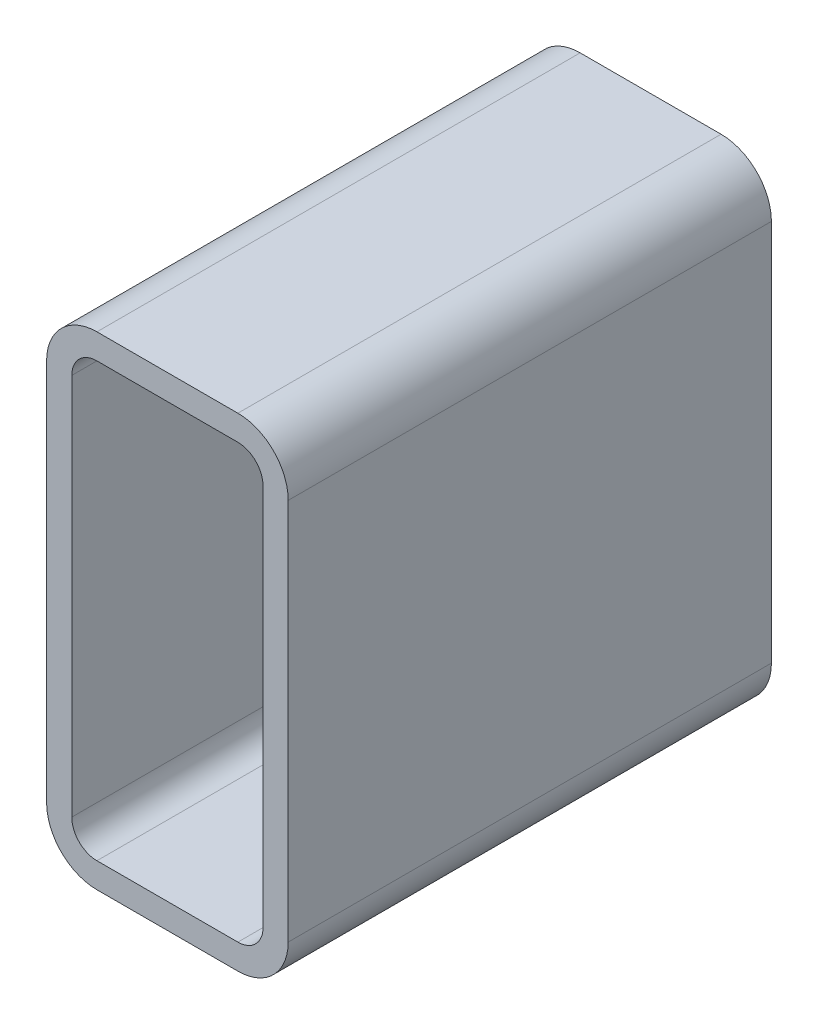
ISO-10303-21;
HEADER;
FILE_DESCRIPTION(('STEP AP214'),'2;1');
FILE_NAME('part.step','',(''),(''),'','','');
FILE_SCHEMA(('AUTOMOTIVE_DESIGN { 1 0 10303 214 1 1 1 1 }'));
ENDSEC;
DATA;
#1=APPLICATION_CONTEXT('core data for automotive mechanical design processes');
#2=APPLICATION_PROTOCOL_DEFINITION('international standard','automotive_design',2000,#1);
#3=PRODUCT_CONTEXT('',#1,'mechanical');
#4=PRODUCT('Part','Part','',(#3));
#5=PRODUCT_RELATED_PRODUCT_CATEGORY('part','',(#4));
#6=PRODUCT_DEFINITION_FORMATION('','',#4);
#7=PRODUCT_DEFINITION_CONTEXT('part definition',#1,'design');
#8=PRODUCT_DEFINITION('design','',#6,#7);
#9=PRODUCT_DEFINITION_SHAPE('','',#8);
#10=(LENGTH_UNIT() NAMED_UNIT(*) SI_UNIT(.MILLI.,.METRE.));
#11=(NAMED_UNIT(*) PLANE_ANGLE_UNIT() SI_UNIT($,.RADIAN.));
#12=(NAMED_UNIT(*) SI_UNIT($,.STERADIAN.) SOLID_ANGLE_UNIT());
#13=UNCERTAINTY_MEASURE_WITH_UNIT(LENGTH_MEASURE(1.E-05),#10,'distance_accuracy_value','');
#14=(GEOMETRIC_REPRESENTATION_CONTEXT(3) GLOBAL_UNCERTAINTY_ASSIGNED_CONTEXT((#13)) GLOBAL_UNIT_ASSIGNED_CONTEXT((#10,
#11,#12)) REPRESENTATION_CONTEXT('',''));
#15=CARTESIAN_POINT('',(0.,0.,0.));
#16=DIRECTION('',(0.,0.,1.));
#17=DIRECTION('',(1.,0.,0.));
#18=AXIS2_PLACEMENT_3D('',#15,#16,#17);
#19=CARTESIAN_POINT('',(31.7973013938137,274.924496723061,304.8));
#20=DIRECTION('',(0.,0.,1.));
#21=DIRECTION('',(1.,0.,0.));
#22=AXIS2_PLACEMENT_3D('',#19,#20,#21);
#23=PLANE('',#22);
#24=CARTESIAN_POINT('',(31.7973013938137,274.924496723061,304.8));
#25=DIRECTION('',(0.,0.,1.));
#26=DIRECTION('',(1.,0.,0.));
#27=AXIS2_PLACEMENT_3D('',#24,#25,#26);
#28=CIRCLE('',#27,31.75);
#29=CARTESIAN_POINT('',(31.7973013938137,306.674496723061,304.8));
#30=VERTEX_POINT('',#29);
#31=CARTESIAN_POINT('',(0.0473013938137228,274.924496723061,304.8));
#32=VERTEX_POINT('',#31);
#33=EDGE_CURVE('E211',#30,#32,#28,.T.);
#34=ORIENTED_EDGE('',*,*,#33,.T.);
#35=DIRECTION('',(0.,-1.,0.));
#36=VECTOR('',#35,1.);
#37=CARTESIAN_POINT('',(0.0473013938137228,33.6244967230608,304.8));
#38=LINE('',#37,#36);
#39=CARTESIAN_POINT('',(0.0473013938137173,33.6244967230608,304.8));
#40=VERTEX_POINT('',#39);
#41=EDGE_CURVE('E214',#32,#40,#38,.T.);
#42=ORIENTED_EDGE('',*,*,#41,.T.);
#43=CARTESIAN_POINT('',(31.7973013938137,33.6244967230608,304.8));
#44=DIRECTION('',(0.,0.,1.));
#45=DIRECTION('',(1.,0.,0.));
#46=AXIS2_PLACEMENT_3D('',#43,#44,#45);
#47=CIRCLE('',#46,31.75);
#48=CARTESIAN_POINT('',(31.7973013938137,1.87449672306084,304.8));
#49=VERTEX_POINT('',#48);
#50=EDGE_CURVE('E217',#40,#49,#47,.T.);
#51=ORIENTED_EDGE('',*,*,#50,.T.);
#52=DIRECTION('',(1.,0.,0.));
#53=VECTOR('',#52,1.);
#54=CARTESIAN_POINT('',(120.697301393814,1.87449672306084,304.8));
#55=LINE('',#54,#53);
#56=CARTESIAN_POINT('',(120.697301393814,1.87449672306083,304.8));
#57=VERTEX_POINT('',#56);
#58=EDGE_CURVE('E219',#49,#57,#55,.T.);
#59=ORIENTED_EDGE('',*,*,#58,.T.);
#60=CARTESIAN_POINT('',(120.697301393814,33.6244967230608,304.8));
#61=DIRECTION('',(0.,0.,1.));
#62=DIRECTION('',(1.,0.,0.));
#63=AXIS2_PLACEMENT_3D('',#60,#61,#62);
#64=CIRCLE('',#63,31.75);
#65=CARTESIAN_POINT('',(152.447301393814,33.6244967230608,304.8));
#66=VERTEX_POINT('',#65);
#67=EDGE_CURVE('E221',#57,#66,#64,.T.);
#68=ORIENTED_EDGE('',*,*,#67,.T.);
#69=DIRECTION('',(0.,1.,0.));
#70=VECTOR('',#69,1.);
#71=CARTESIAN_POINT('',(152.447301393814,274.924496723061,304.8));
#72=LINE('',#71,#70);
#73=CARTESIAN_POINT('',(152.447301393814,274.924496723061,304.8));
#74=VERTEX_POINT('',#73);
#75=EDGE_CURVE('E223',#66,#74,#72,.T.);
#76=ORIENTED_EDGE('',*,*,#75,.T.);
#77=CARTESIAN_POINT('',(120.697301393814,274.924496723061,304.8));
#78=DIRECTION('',(0.,0.,1.));
#79=DIRECTION('',(1.,0.,0.));
#80=AXIS2_PLACEMENT_3D('',#77,#78,#79);
#81=CIRCLE('',#80,31.75);
#82=CARTESIAN_POINT('',(120.697301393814,306.674496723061,304.8));
#83=VERTEX_POINT('',#82);
#84=EDGE_CURVE('E225',#74,#83,#81,.T.);
#85=ORIENTED_EDGE('',*,*,#84,.T.);
#86=DIRECTION('',(-1.,0.,0.));
#87=VECTOR('',#86,1.);
#88=CARTESIAN_POINT('',(31.7973013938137,306.674496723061,304.8));
#89=LINE('',#88,#87);
#90=EDGE_CURVE('E227',#83,#30,#89,.T.);
#91=ORIENTED_EDGE('',*,*,#90,.T.);
#92=EDGE_LOOP('',(#34,#42,#51,#59,#68,#76,#85,#91));
#93=FACE_BOUND('',#92,.T.);
#94=DIRECTION('',(0.,-1.,0.));
#95=VECTOR('',#94,1.);
#96=CARTESIAN_POINT('',(15.9223013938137,33.6244967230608,304.8));
#97=LINE('',#96,#95);
#98=CARTESIAN_POINT('',(15.9223013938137,274.924496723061,304.8));
#99=VERTEX_POINT('',#98);
#100=CARTESIAN_POINT('',(15.9223013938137,33.6244967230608,304.8));
#101=VERTEX_POINT('',#100);
#102=EDGE_CURVE('E154',#99,#101,#97,.T.);
#103=ORIENTED_EDGE('',*,*,#102,.F.);
#104=CARTESIAN_POINT('',(31.7973013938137,274.924496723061,304.8));
#105=DIRECTION('',(0.,0.,1.));
#106=DIRECTION('',(1.,0.,0.));
#107=AXIS2_PLACEMENT_3D('',#104,#105,#106);
#108=CIRCLE('',#107,15.875);
#109=CARTESIAN_POINT('',(31.7973013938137,290.799496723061,304.8));
#110=VERTEX_POINT('',#109);
#111=EDGE_CURVE('E146',#110,#99,#108,.T.);
#112=ORIENTED_EDGE('',*,*,#111,.F.);
#113=DIRECTION('',(-1.,0.,0.));
#114=VECTOR('',#113,1.);
#115=CARTESIAN_POINT('',(31.7973013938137,290.799496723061,304.8));
#116=LINE('',#115,#114);
#117=CARTESIAN_POINT('',(120.697301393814,290.799496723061,304.8));
#118=VERTEX_POINT('',#117);
#119=EDGE_CURVE('E179',#118,#110,#116,.T.);
#120=ORIENTED_EDGE('',*,*,#119,.F.);
#121=CARTESIAN_POINT('',(120.697301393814,274.924496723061,304.8));
#122=DIRECTION('',(0.,0.,1.));
#123=DIRECTION('',(1.,0.,0.));
#124=AXIS2_PLACEMENT_3D('',#121,#122,#123);
#125=CIRCLE('',#124,15.875);
#126=CARTESIAN_POINT('',(136.572301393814,274.924496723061,304.8));
#127=VERTEX_POINT('',#126);
#128=EDGE_CURVE('E177',#127,#118,#125,.T.);
#129=ORIENTED_EDGE('',*,*,#128,.F.);
#130=DIRECTION('',(0.,1.,0.));
#131=VECTOR('',#130,1.);
#132=CARTESIAN_POINT('',(136.572301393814,274.924496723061,304.8));
#133=LINE('',#132,#131);
#134=CARTESIAN_POINT('',(136.572301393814,33.6244967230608,304.8));
#135=VERTEX_POINT('',#134);
#136=EDGE_CURVE('E175',#135,#127,#133,.T.);
#137=ORIENTED_EDGE('',*,*,#136,.F.);
#138=CARTESIAN_POINT('',(120.697301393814,33.6244967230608,304.8));
#139=DIRECTION('',(0.,0.,1.));
#140=DIRECTION('',(1.,0.,0.));
#141=AXIS2_PLACEMENT_3D('',#138,#139,#140);
#142=CIRCLE('',#141,15.875);
#143=CARTESIAN_POINT('',(120.697301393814,17.7494967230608,304.8));
#144=VERTEX_POINT('',#143);
#145=EDGE_CURVE('E173',#144,#135,#142,.T.);
#146=ORIENTED_EDGE('',*,*,#145,.F.);
#147=DIRECTION('',(1.,0.,0.));
#148=VECTOR('',#147,1.);
#149=CARTESIAN_POINT('',(120.697301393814,17.7494967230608,304.8));
#150=LINE('',#149,#148);
#151=CARTESIAN_POINT('',(31.7973013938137,17.7494967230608,304.8));
#152=VERTEX_POINT('',#151);
#153=EDGE_CURVE('E169',#152,#144,#150,.T.);
#154=ORIENTED_EDGE('',*,*,#153,.F.);
#155=CARTESIAN_POINT('',(31.7973013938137,33.6244967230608,304.8));
#156=DIRECTION('',(0.,0.,1.));
#157=DIRECTION('',(1.,0.,0.));
#158=AXIS2_PLACEMENT_3D('',#155,#156,#157);
#159=CIRCLE('',#158,15.875);
#160=EDGE_CURVE('E167',#101,#152,#159,.T.);
#161=ORIENTED_EDGE('',*,*,#160,.F.);
#162=EDGE_LOOP('',(#103,#112,#120,#129,#137,#146,#154,#161));
#163=FACE_BOUND('',#162,.T.);
#164=ADVANCED_FACE('F33',(#93,#163),#23,.T.);
#165=CARTESIAN_POINT('',(31.7973013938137,274.924496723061,0.));
#166=DIRECTION('',(0.,0.,1.));
#167=DIRECTION('',(1.,0.,0.));
#168=AXIS2_PLACEMENT_3D('',#165,#166,#167);
#169=PLANE('',#168);
#170=CARTESIAN_POINT('',(31.7973013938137,274.924496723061,0.));
#171=DIRECTION('',(0.,0.,1.));
#172=DIRECTION('',(1.,0.,0.));
#173=AXIS2_PLACEMENT_3D('',#170,#171,#172);
#174=CIRCLE('',#173,31.75);
#175=CARTESIAN_POINT('',(31.7973013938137,306.674496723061,0.));
#176=VERTEX_POINT('',#175);
#177=CARTESIAN_POINT('',(0.0473013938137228,274.924496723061,0.));
#178=VERTEX_POINT('',#177);
#179=EDGE_CURVE('E162',#176,#178,#174,.T.);
#180=ORIENTED_EDGE('',*,*,#179,.F.);
#181=DIRECTION('',(-1.,0.,0.));
#182=VECTOR('',#181,1.);
#183=CARTESIAN_POINT('',(31.7973013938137,306.674496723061,0.));
#184=LINE('',#183,#182);
#185=CARTESIAN_POINT('',(120.697301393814,306.674496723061,0.));
#186=VERTEX_POINT('',#185);
#187=EDGE_CURVE('E215',#186,#176,#184,.T.);
#188=ORIENTED_EDGE('',*,*,#187,.F.);
#189=CARTESIAN_POINT('',(120.697301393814,274.924496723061,0.));
#190=DIRECTION('',(0.,0.,1.));
#191=DIRECTION('',(1.,0.,0.));
#192=AXIS2_PLACEMENT_3D('',#189,#190,#191);
#193=CIRCLE('',#192,31.75);
#194=CARTESIAN_POINT('',(152.447301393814,274.924496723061,0.));
#195=VERTEX_POINT('',#194);
#196=EDGE_CURVE('E242',#195,#186,#193,.T.);
#197=ORIENTED_EDGE('',*,*,#196,.F.);
#198=DIRECTION('',(0.,1.,0.));
#199=VECTOR('',#198,1.);
#200=CARTESIAN_POINT('',(152.447301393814,274.924496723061,0.));
#201=LINE('',#200,#199);
#202=CARTESIAN_POINT('',(152.447301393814,33.6244967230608,0.));
#203=VERTEX_POINT('',#202);
#204=EDGE_CURVE('E240',#203,#195,#201,.T.);
#205=ORIENTED_EDGE('',*,*,#204,.F.);
#206=CARTESIAN_POINT('',(120.697301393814,33.6244967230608,0.));
#207=DIRECTION('',(0.,0.,1.));
#208=DIRECTION('',(1.,0.,0.));
#209=AXIS2_PLACEMENT_3D('',#206,#207,#208);
#210=CIRCLE('',#209,31.75);
#211=CARTESIAN_POINT('',(120.697301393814,1.87449672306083,0.));
#212=VERTEX_POINT('',#211);
#213=EDGE_CURVE('E238',#212,#203,#210,.T.);
#214=ORIENTED_EDGE('',*,*,#213,.F.);
#215=DIRECTION('',(1.,0.,0.));
#216=VECTOR('',#215,1.);
#217=CARTESIAN_POINT('',(120.697301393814,1.87449672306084,0.));
#218=LINE('',#217,#216);
#219=CARTESIAN_POINT('',(31.7973013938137,1.87449672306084,0.));
#220=VERTEX_POINT('',#219);
#221=EDGE_CURVE('E236',#220,#212,#218,.T.);
#222=ORIENTED_EDGE('',*,*,#221,.F.);
#223=CARTESIAN_POINT('',(31.7973013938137,33.6244967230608,0.));
#224=DIRECTION('',(0.,0.,1.));
#225=DIRECTION('',(1.,0.,0.));
#226=AXIS2_PLACEMENT_3D('',#223,#224,#225);
#227=CIRCLE('',#226,31.75);
#228=CARTESIAN_POINT('',(0.0473013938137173,33.6244967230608,0.));
#229=VERTEX_POINT('',#228);
#230=EDGE_CURVE('E234',#229,#220,#227,.T.);
#231=ORIENTED_EDGE('',*,*,#230,.F.);
#232=DIRECTION('',(0.,-1.,0.));
#233=VECTOR('',#232,1.);
#234=CARTESIAN_POINT('',(0.0473013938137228,33.6244967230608,0.));
#235=LINE('',#234,#233);
#236=EDGE_CURVE('E232',#178,#229,#235,.T.);
#237=ORIENTED_EDGE('',*,*,#236,.F.);
#238=EDGE_LOOP('',(#180,#188,#197,#205,#214,#222,#231,#237));
#239=FACE_BOUND('',#238,.T.);
#240=CARTESIAN_POINT('',(31.7973013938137,274.924496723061,0.));
#241=DIRECTION('',(0.,0.,1.));
#242=DIRECTION('',(1.,0.,0.));
#243=AXIS2_PLACEMENT_3D('',#240,#241,#242);
#244=CIRCLE('',#243,15.875);
#245=CARTESIAN_POINT('',(31.7973013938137,290.799496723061,0.));
#246=VERTEX_POINT('',#245);
#247=CARTESIAN_POINT('',(15.9223013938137,274.924496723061,0.));
#248=VERTEX_POINT('',#247);
#249=EDGE_CURVE('E56',#246,#248,#244,.T.);
#250=ORIENTED_EDGE('',*,*,#249,.T.);
#251=DIRECTION('',(0.,-1.,0.));
#252=VECTOR('',#251,1.);
#253=CARTESIAN_POINT('',(15.9223013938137,33.6244967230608,0.));
#254=LINE('',#253,#252);
#255=CARTESIAN_POINT('',(15.9223013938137,33.6244967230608,0.));
#256=VERTEX_POINT('',#255);
#257=EDGE_CURVE('E161',#248,#256,#254,.T.);
#258=ORIENTED_EDGE('',*,*,#257,.T.);
#259=CARTESIAN_POINT('',(31.7973013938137,33.6244967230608,0.));
#260=DIRECTION('',(0.,0.,1.));
#261=DIRECTION('',(1.,0.,0.));
#262=AXIS2_PLACEMENT_3D('',#259,#260,#261);
#263=CIRCLE('',#262,15.875);
#264=CARTESIAN_POINT('',(31.7973013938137,17.7494967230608,0.));
#265=VERTEX_POINT('',#264);
#266=EDGE_CURVE('E183',#256,#265,#263,.T.);
#267=ORIENTED_EDGE('',*,*,#266,.T.);
#268=DIRECTION('',(1.,0.,0.));
#269=VECTOR('',#268,1.);
#270=CARTESIAN_POINT('',(120.697301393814,17.7494967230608,0.));
#271=LINE('',#270,#269);
#272=CARTESIAN_POINT('',(120.697301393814,17.7494967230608,0.));
#273=VERTEX_POINT('',#272);
#274=EDGE_CURVE('E186',#265,#273,#271,.T.);
#275=ORIENTED_EDGE('',*,*,#274,.T.);
#276=CARTESIAN_POINT('',(120.697301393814,33.6244967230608,0.));
#277=DIRECTION('',(0.,0.,1.));
#278=DIRECTION('',(1.,0.,0.));
#279=AXIS2_PLACEMENT_3D('',#276,#277,#278);
#280=CIRCLE('',#279,15.875);
#281=CARTESIAN_POINT('',(136.572301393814,33.6244967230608,0.));
#282=VERTEX_POINT('',#281);
#283=EDGE_CURVE('E189',#273,#282,#280,.T.);
#284=ORIENTED_EDGE('',*,*,#283,.T.);
#285=DIRECTION('',(0.,1.,0.));
#286=VECTOR('',#285,1.);
#287=CARTESIAN_POINT('',(136.572301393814,274.924496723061,0.));
#288=LINE('',#287,#286);
#289=CARTESIAN_POINT('',(136.572301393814,274.924496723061,0.));
#290=VERTEX_POINT('',#289);
#291=EDGE_CURVE('E192',#282,#290,#288,.T.);
#292=ORIENTED_EDGE('',*,*,#291,.T.);
#293=CARTESIAN_POINT('',(120.697301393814,274.924496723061,0.));
#294=DIRECTION('',(0.,0.,1.));
#295=DIRECTION('',(1.,0.,0.));
#296=AXIS2_PLACEMENT_3D('',#293,#294,#295);
#297=CIRCLE('',#296,15.875);
#298=CARTESIAN_POINT('',(120.697301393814,290.799496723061,0.));
#299=VERTEX_POINT('',#298);
#300=EDGE_CURVE('E195',#290,#299,#297,.T.);
#301=ORIENTED_EDGE('',*,*,#300,.T.);
#302=DIRECTION('',(-1.,0.,0.));
#303=VECTOR('',#302,1.);
#304=CARTESIAN_POINT('',(31.7973013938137,290.799496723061,0.));
#305=LINE('',#304,#303);
#306=EDGE_CURVE('E155',#299,#246,#305,.T.);
#307=ORIENTED_EDGE('',*,*,#306,.T.);
#308=EDGE_LOOP('',(#250,#258,#267,#275,#284,#292,#301,#307));
#309=FACE_BOUND('',#308,.T.);
#310=ADVANCED_FACE('F272',(#239,#309),#169,.F.);
#311=CARTESIAN_POINT('',(31.7973013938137,274.924496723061,304.8));
#312=DIRECTION('',(0.,0.,-1.));
#313=DIRECTION('',(-1.,0.,0.));
#314=AXIS2_PLACEMENT_3D('',#311,#312,#313);
#315=CYLINDRICAL_SURFACE('',#314,31.75);
#316=ORIENTED_EDGE('',*,*,#179,.T.);
#317=DIRECTION('',(0.,0.,-1.));
#318=VECTOR('',#317,1.);
#319=CARTESIAN_POINT('',(0.0473013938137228,274.924496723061,304.8));
#320=LINE('',#319,#318);
#321=EDGE_CURVE('E11',#32,#178,#320,.T.);
#322=ORIENTED_EDGE('',*,*,#321,.F.);
#323=ORIENTED_EDGE('',*,*,#33,.F.);
#324=DIRECTION('',(0.,0.,-1.));
#325=VECTOR('',#324,1.);
#326=CARTESIAN_POINT('',(31.7973013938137,306.674496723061,304.8));
#327=LINE('',#326,#325);
#328=EDGE_CURVE('E229',#30,#176,#327,.T.);
#329=ORIENTED_EDGE('',*,*,#328,.T.);
#330=EDGE_LOOP('',(#316,#322,#323,#329));
#331=FACE_BOUND('',#330,.T.);
#332=ADVANCED_FACE('F35',(#331),#315,.T.);
#333=CARTESIAN_POINT('',(0.0473013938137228,33.6244967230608,304.8));
#334=DIRECTION('',(1.,0.,0.));
#335=DIRECTION('',(0.,0.,-1.));
#336=AXIS2_PLACEMENT_3D('',#333,#334,#335);
#337=PLANE('',#336);
#338=ORIENTED_EDGE('',*,*,#236,.T.);
#339=DIRECTION('',(0.,0.,-1.));
#340=VECTOR('',#339,1.);
#341=CARTESIAN_POINT('',(0.0473013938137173,33.6244967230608,304.8));
#342=LINE('',#341,#340);
#343=EDGE_CURVE('E41',#40,#229,#342,.T.);
#344=ORIENTED_EDGE('',*,*,#343,.F.);
#345=ORIENTED_EDGE('',*,*,#41,.F.);
#346=ORIENTED_EDGE('',*,*,#321,.T.);
#347=EDGE_LOOP('',(#338,#344,#345,#346));
#348=FACE_BOUND('',#347,.T.);
#349=ADVANCED_FACE('F289',(#348),#337,.F.);
#350=CARTESIAN_POINT('',(31.7973013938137,33.6244967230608,304.8));
#351=DIRECTION('',(0.,0.,-1.));
#352=DIRECTION('',(-1.,0.,0.));
#353=AXIS2_PLACEMENT_3D('',#350,#351,#352);
#354=CYLINDRICAL_SURFACE('',#353,31.75);
#355=ORIENTED_EDGE('',*,*,#230,.T.);
#356=DIRECTION('',(0.,0.,-1.));
#357=VECTOR('',#356,1.);
#358=CARTESIAN_POINT('',(31.7973013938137,1.87449672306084,304.8));
#359=LINE('',#358,#357);
#360=EDGE_CURVE('E259',#49,#220,#359,.T.);
#361=ORIENTED_EDGE('',*,*,#360,.F.);
#362=ORIENTED_EDGE('',*,*,#50,.F.);
#363=ORIENTED_EDGE('',*,*,#343,.T.);
#364=EDGE_LOOP('',(#355,#361,#362,#363));
#365=FACE_BOUND('',#364,.T.);
#366=ADVANCED_FACE('F266',(#365),#354,.T.);
#367=CARTESIAN_POINT('',(120.697301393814,1.87449672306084,304.8));
#368=DIRECTION('',(0.,1.,0.));
#369=DIRECTION('',(0.,0.,1.));
#370=AXIS2_PLACEMENT_3D('',#367,#368,#369);
#371=PLANE('',#370);
#372=ORIENTED_EDGE('',*,*,#221,.T.);
#373=DIRECTION('',(0.,0.,-1.));
#374=VECTOR('',#373,1.);
#375=CARTESIAN_POINT('',(120.697301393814,1.87449672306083,304.8));
#376=LINE('',#375,#374);
#377=EDGE_CURVE('E256',#57,#212,#376,.T.);
#378=ORIENTED_EDGE('',*,*,#377,.F.);
#379=ORIENTED_EDGE('',*,*,#58,.F.);
#380=ORIENTED_EDGE('',*,*,#360,.T.);
#381=EDGE_LOOP('',(#372,#378,#379,#380));
#382=FACE_BOUND('',#381,.T.);
#383=ADVANCED_FACE('F278',(#382),#371,.F.);
#384=CARTESIAN_POINT('',(120.697301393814,33.6244967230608,304.8));
#385=DIRECTION('',(0.,0.,-1.));
#386=DIRECTION('',(-1.,0.,0.));
#387=AXIS2_PLACEMENT_3D('',#384,#385,#386);
#388=CYLINDRICAL_SURFACE('',#387,31.75);
#389=ORIENTED_EDGE('',*,*,#213,.T.);
#390=DIRECTION('',(0.,0.,-1.));
#391=VECTOR('',#390,1.);
#392=CARTESIAN_POINT('',(152.447301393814,33.6244967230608,304.8));
#393=LINE('',#392,#391);
#394=EDGE_CURVE('E253',#66,#203,#393,.T.);
#395=ORIENTED_EDGE('',*,*,#394,.F.);
#396=ORIENTED_EDGE('',*,*,#67,.F.);
#397=ORIENTED_EDGE('',*,*,#377,.T.);
#398=EDGE_LOOP('',(#389,#395,#396,#397));
#399=FACE_BOUND('',#398,.T.);
#400=ADVANCED_FACE('F282',(#399),#388,.T.);
#401=CARTESIAN_POINT('',(152.447301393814,274.924496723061,304.8));
#402=DIRECTION('',(-1.,0.,0.));
#403=DIRECTION('',(0.,0.,1.));
#404=AXIS2_PLACEMENT_3D('',#401,#402,#403);
#405=PLANE('',#404);
#406=ORIENTED_EDGE('',*,*,#204,.T.);
#407=DIRECTION('',(0.,0.,-1.));
#408=VECTOR('',#407,1.);
#409=CARTESIAN_POINT('',(152.447301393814,274.924496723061,304.8));
#410=LINE('',#409,#408);
#411=EDGE_CURVE('E250',#74,#195,#410,.T.);
#412=ORIENTED_EDGE('',*,*,#411,.F.);
#413=ORIENTED_EDGE('',*,*,#75,.F.);
#414=ORIENTED_EDGE('',*,*,#394,.T.);
#415=EDGE_LOOP('',(#406,#412,#413,#414));
#416=FACE_BOUND('',#415,.T.);
#417=ADVANCED_FACE('F302',(#416),#405,.F.);
#418=CARTESIAN_POINT('',(120.697301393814,274.924496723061,304.8));
#419=DIRECTION('',(0.,0.,-1.));
#420=DIRECTION('',(-1.,0.,0.));
#421=AXIS2_PLACEMENT_3D('',#418,#419,#420);
#422=CYLINDRICAL_SURFACE('',#421,31.75);
#423=ORIENTED_EDGE('',*,*,#196,.T.);
#424=DIRECTION('',(0.,0.,-1.));
#425=VECTOR('',#424,1.);
#426=CARTESIAN_POINT('',(120.697301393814,306.674496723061,304.8));
#427=LINE('',#426,#425);
#428=EDGE_CURVE('E247',#83,#186,#427,.T.);
#429=ORIENTED_EDGE('',*,*,#428,.F.);
#430=ORIENTED_EDGE('',*,*,#84,.F.);
#431=ORIENTED_EDGE('',*,*,#411,.T.);
#432=EDGE_LOOP('',(#423,#429,#430,#431));
#433=FACE_BOUND('',#432,.T.);
#434=ADVANCED_FACE('F300',(#433),#422,.T.);
#435=CARTESIAN_POINT('',(31.7973013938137,306.674496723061,304.8));
#436=DIRECTION('',(0.,-1.,0.));
#437=DIRECTION('',(0.,0.,-1.));
#438=AXIS2_PLACEMENT_3D('',#435,#436,#437);
#439=PLANE('',#438);
#440=ORIENTED_EDGE('',*,*,#187,.T.);
#441=ORIENTED_EDGE('',*,*,#328,.F.);
#442=ORIENTED_EDGE('',*,*,#90,.F.);
#443=ORIENTED_EDGE('',*,*,#428,.T.);
#444=EDGE_LOOP('',(#440,#441,#442,#443));
#445=FACE_BOUND('',#444,.T.);
#446=ADVANCED_FACE('F295',(#445),#439,.F.);
#447=CARTESIAN_POINT('',(31.7973013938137,274.924496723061,304.8));
#448=DIRECTION('',(0.,0.,-1.));
#449=DIRECTION('',(-1.,0.,0.));
#450=AXIS2_PLACEMENT_3D('',#447,#448,#449);
#451=CYLINDRICAL_SURFACE('',#450,15.875);
#452=ORIENTED_EDGE('',*,*,#249,.F.);
#453=DIRECTION('',(0.,0.,-1.));
#454=VECTOR('',#453,1.);
#455=CARTESIAN_POINT('',(31.7973013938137,290.799496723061,304.8));
#456=LINE('',#455,#454);
#457=EDGE_CURVE('E150',#110,#246,#456,.T.);
#458=ORIENTED_EDGE('',*,*,#457,.F.);
#459=ORIENTED_EDGE('',*,*,#111,.T.);
#460=DIRECTION('',(0.,0.,-1.));
#461=VECTOR('',#460,1.);
#462=CARTESIAN_POINT('',(15.9223013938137,274.924496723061,304.8));
#463=LINE('',#462,#461);
#464=EDGE_CURVE('E149',#99,#248,#463,.T.);
#465=ORIENTED_EDGE('',*,*,#464,.T.);
#466=EDGE_LOOP('',(#452,#458,#459,#465));
#467=FACE_BOUND('',#466,.T.);
#468=ADVANCED_FACE('F148',(#467),#451,.F.);
#469=CARTESIAN_POINT('',(15.9223013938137,33.6244967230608,304.8));
#470=DIRECTION('',(1.,0.,0.));
#471=DIRECTION('',(0.,0.,-1.));
#472=AXIS2_PLACEMENT_3D('',#469,#470,#471);
#473=PLANE('',#472);
#474=ORIENTED_EDGE('',*,*,#257,.F.);
#475=ORIENTED_EDGE('',*,*,#464,.F.);
#476=ORIENTED_EDGE('',*,*,#102,.T.);
#477=DIRECTION('',(0.,0.,-1.));
#478=VECTOR('',#477,1.);
#479=CARTESIAN_POINT('',(15.9223013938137,33.6244967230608,304.8));
#480=LINE('',#479,#478);
#481=EDGE_CURVE('E163',#101,#256,#480,.T.);
#482=ORIENTED_EDGE('',*,*,#481,.T.);
#483=EDGE_LOOP('',(#474,#475,#476,#482));
#484=FACE_BOUND('',#483,.T.);
#485=ADVANCED_FACE('F158',(#484),#473,.T.);
#486=CARTESIAN_POINT('',(31.7973013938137,33.6244967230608,304.8));
#487=DIRECTION('',(0.,0.,-1.));
#488=DIRECTION('',(-1.,0.,0.));
#489=AXIS2_PLACEMENT_3D('',#486,#487,#488);
#490=CYLINDRICAL_SURFACE('',#489,15.875);
#491=ORIENTED_EDGE('',*,*,#266,.F.);
#492=ORIENTED_EDGE('',*,*,#481,.F.);
#493=ORIENTED_EDGE('',*,*,#160,.T.);
#494=DIRECTION('',(0.,0.,-1.));
#495=VECTOR('',#494,1.);
#496=CARTESIAN_POINT('',(31.7973013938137,17.7494967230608,304.8));
#497=LINE('',#496,#495);
#498=EDGE_CURVE('E208',#152,#265,#497,.T.);
#499=ORIENTED_EDGE('',*,*,#498,.T.);
#500=EDGE_LOOP('',(#491,#492,#493,#499));
#501=FACE_BOUND('',#500,.T.);
#502=ADVANCED_FACE('F327',(#501),#490,.F.);
#503=CARTESIAN_POINT('',(120.697301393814,17.7494967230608,304.8));
#504=DIRECTION('',(0.,1.,0.));
#505=DIRECTION('',(0.,0.,1.));
#506=AXIS2_PLACEMENT_3D('',#503,#504,#505);
#507=PLANE('',#506);
#508=ORIENTED_EDGE('',*,*,#274,.F.);
#509=ORIENTED_EDGE('',*,*,#498,.F.);
#510=ORIENTED_EDGE('',*,*,#153,.T.);
#511=DIRECTION('',(0.,0.,-1.));
#512=VECTOR('',#511,1.);
#513=CARTESIAN_POINT('',(120.697301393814,17.7494967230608,304.8));
#514=LINE('',#513,#512);
#515=EDGE_CURVE('E206',#144,#273,#514,.T.);
#516=ORIENTED_EDGE('',*,*,#515,.T.);
#517=EDGE_LOOP('',(#508,#509,#510,#516));
#518=FACE_BOUND('',#517,.T.);
#519=ADVANCED_FACE('F331',(#518),#507,.T.);
#520=CARTESIAN_POINT('',(120.697301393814,33.6244967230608,304.8));
#521=DIRECTION('',(0.,0.,-1.));
#522=DIRECTION('',(-1.,0.,0.));
#523=AXIS2_PLACEMENT_3D('',#520,#521,#522);
#524=CYLINDRICAL_SURFACE('',#523,15.875);
#525=ORIENTED_EDGE('',*,*,#283,.F.);
#526=ORIENTED_EDGE('',*,*,#515,.F.);
#527=ORIENTED_EDGE('',*,*,#145,.T.);
#528=DIRECTION('',(0.,0.,-1.));
#529=VECTOR('',#528,1.);
#530=CARTESIAN_POINT('',(136.572301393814,33.6244967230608,304.8));
#531=LINE('',#530,#529);
#532=EDGE_CURVE('E204',#135,#282,#531,.T.);
#533=ORIENTED_EDGE('',*,*,#532,.T.);
#534=EDGE_LOOP('',(#525,#526,#527,#533));
#535=FACE_BOUND('',#534,.T.);
#536=ADVANCED_FACE('F337',(#535),#524,.F.);
#537=CARTESIAN_POINT('',(136.572301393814,274.924496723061,304.8));
#538=DIRECTION('',(-1.,0.,0.));
#539=DIRECTION('',(0.,0.,1.));
#540=AXIS2_PLACEMENT_3D('',#537,#538,#539);
#541=PLANE('',#540);
#542=ORIENTED_EDGE('',*,*,#291,.F.);
#543=ORIENTED_EDGE('',*,*,#532,.F.);
#544=ORIENTED_EDGE('',*,*,#136,.T.);
#545=DIRECTION('',(0.,0.,-1.));
#546=VECTOR('',#545,1.);
#547=CARTESIAN_POINT('',(136.572301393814,274.924496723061,304.8));
#548=LINE('',#547,#546);
#549=EDGE_CURVE('E202',#127,#290,#548,.T.);
#550=ORIENTED_EDGE('',*,*,#549,.T.);
#551=EDGE_LOOP('',(#542,#543,#544,#550));
#552=FACE_BOUND('',#551,.T.);
#553=ADVANCED_FACE('F341',(#552),#541,.T.);
#554=CARTESIAN_POINT('',(120.697301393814,274.924496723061,304.8));
#555=DIRECTION('',(0.,0.,-1.));
#556=DIRECTION('',(-1.,0.,0.));
#557=AXIS2_PLACEMENT_3D('',#554,#555,#556);
#558=CYLINDRICAL_SURFACE('',#557,15.875);
#559=ORIENTED_EDGE('',*,*,#300,.F.);
#560=ORIENTED_EDGE('',*,*,#549,.F.);
#561=ORIENTED_EDGE('',*,*,#128,.T.);
#562=DIRECTION('',(0.,0.,-1.));
#563=VECTOR('',#562,1.);
#564=CARTESIAN_POINT('',(120.697301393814,290.799496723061,304.8));
#565=LINE('',#564,#563);
#566=EDGE_CURVE('E48',#118,#299,#565,.T.);
#567=ORIENTED_EDGE('',*,*,#566,.T.);
#568=EDGE_LOOP('',(#559,#560,#561,#567));
#569=FACE_BOUND('',#568,.T.);
#570=ADVANCED_FACE('F345',(#569),#558,.F.);
#571=CARTESIAN_POINT('',(31.7973013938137,290.799496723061,304.8));
#572=DIRECTION('',(0.,-1.,0.));
#573=DIRECTION('',(0.,0.,-1.));
#574=AXIS2_PLACEMENT_3D('',#571,#572,#573);
#575=PLANE('',#574);
#576=ORIENTED_EDGE('',*,*,#306,.F.);
#577=ORIENTED_EDGE('',*,*,#566,.F.);
#578=ORIENTED_EDGE('',*,*,#119,.T.);
#579=ORIENTED_EDGE('',*,*,#457,.T.);
#580=EDGE_LOOP('',(#576,#577,#578,#579));
#581=FACE_BOUND('',#580,.T.);
#582=ADVANCED_FACE('F349',(#581),#575,.T.);
#583=CLOSED_SHELL('',(#164,#310,#332,#349,#366,#383,#400,#417,#434,#446,#468,#485,#502,#519,
#536,#553,#570,#582));
#584=MANIFOLD_SOLID_BREP('B2',#583);
#585=ADVANCED_BREP_SHAPE_REPRESENTATION('',(#18,#584),#14);
#586=SHAPE_DEFINITION_REPRESENTATION(#9,#585);
ENDSEC;
END-ISO-10303-21;
